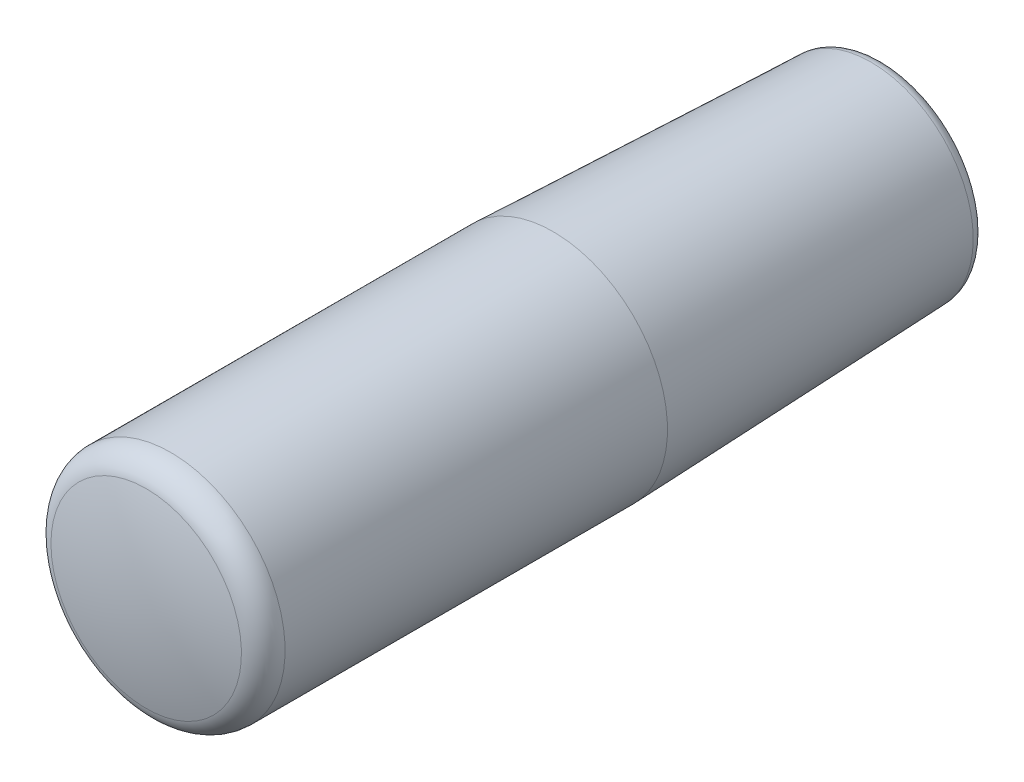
ISO-10303-21;
HEADER;
FILE_DESCRIPTION(('STEP AP214'),'2;1');
FILE_NAME('part.step','',(''),(''),'','','');
FILE_SCHEMA(('AUTOMOTIVE_DESIGN { 1 0 10303 214 1 1 1 1 }'));
ENDSEC;
DATA;
#1=APPLICATION_CONTEXT('core data for automotive mechanical design processes');
#2=APPLICATION_PROTOCOL_DEFINITION('international standard','automotive_design',2000,#1);
#3=PRODUCT_CONTEXT('',#1,'mechanical');
#4=PRODUCT('Part','Part','',(#3));
#5=PRODUCT_RELATED_PRODUCT_CATEGORY('part','',(#4));
#6=PRODUCT_DEFINITION_FORMATION('','',#4);
#7=PRODUCT_DEFINITION_CONTEXT('part definition',#1,'design');
#8=PRODUCT_DEFINITION('design','',#6,#7);
#9=PRODUCT_DEFINITION_SHAPE('','',#8);
#10=(LENGTH_UNIT() NAMED_UNIT(*) SI_UNIT(.MILLI.,.METRE.));
#11=(NAMED_UNIT(*) PLANE_ANGLE_UNIT() SI_UNIT($,.RADIAN.));
#12=(NAMED_UNIT(*) SI_UNIT($,.STERADIAN.) SOLID_ANGLE_UNIT());
#13=UNCERTAINTY_MEASURE_WITH_UNIT(LENGTH_MEASURE(1.E-05),#10,'distance_accuracy_value','');
#14=(GEOMETRIC_REPRESENTATION_CONTEXT(3) GLOBAL_UNCERTAINTY_ASSIGNED_CONTEXT((#13)) GLOBAL_UNIT_ASSIGNED_CONTEXT((#10,
#11,#12)) REPRESENTATION_CONTEXT('',''));
#15=CARTESIAN_POINT('',(0.,0.,0.));
#16=DIRECTION('',(0.,0.,1.));
#17=DIRECTION('',(1.,0.,0.));
#18=AXIS2_PLACEMENT_3D('',#15,#16,#17);
#19=CARTESIAN_POINT('',(0.,7.03772216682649,0.));
#20=DIRECTION('',(0.,0.,-1.));
#21=DIRECTION('',(-1.,0.,0.));
#22=AXIS2_PLACEMENT_3D('',#19,#20,#21);
#23=PLANE('',#22);
#24=CARTESIAN_POINT('',(0.,0.,0.));
#25=DIRECTION('',(0.,0.,-1.));
#26=DIRECTION('',(-1.,0.,0.));
#27=AXIS2_PLACEMENT_3D('',#24,#25,#26);
#28=CIRCLE('',#27,3.45);
#29=CARTESIAN_POINT('',(-3.45,0.,0.));
#30=VERTEX_POINT('',#29);
#31=EDGE_CURVE('E8',#30,#30,#28,.F.);
#32=ORIENTED_EDGE('',*,*,#31,.T.);
#33=EDGE_LOOP('',(#32));
#34=FACE_BOUND('',#33,.T.);
#35=CARTESIAN_POINT('',(0.,0.,0.));
#36=DIRECTION('',(0.,0.,-1.));
#37=DIRECTION('',(-1.,0.,0.));
#38=AXIS2_PLACEMENT_3D('',#35,#36,#37);
#39=CIRCLE('',#38,7.03772216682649);
#40=CARTESIAN_POINT('',(-7.03772216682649,0.,0.));
#41=VERTEX_POINT('',#40);
#42=EDGE_CURVE('E23',#41,#41,#39,.T.);
#43=ORIENTED_EDGE('',*,*,#42,.T.);
#44=EDGE_LOOP('',(#43));
#45=FACE_BOUND('',#44,.T.);
#46=ADVANCED_FACE('F12',(#34,#45),#23,.T.);
#47=CARTESIAN_POINT('',(0.,0.,1.));
#48=DIRECTION('',(0.,0.,-1.));
#49=DIRECTION('',(-1.,0.,0.));
#50=AXIS2_PLACEMENT_3D('',#47,#48,#49);
#51=TOROIDAL_SURFACE('',#50,7.03772216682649,1.);
#52=CARTESIAN_POINT('',(0.,0.,0.961566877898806));
#53=DIRECTION('',(0.,0.,-1.));
#54=DIRECTION('',(-1.,0.,0.));
#55=AXIS2_PLACEMENT_3D('',#52,#53,#54);
#56=CIRCLE('',#55,8.0369833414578);
#57=CARTESIAN_POINT('',(-8.0369833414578,0.,0.961566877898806));
#58=VERTEX_POINT('',#57);
#59=EDGE_CURVE('E27',#58,#58,#56,.T.);
#60=ORIENTED_EDGE('',*,*,#59,.T.);
#61=EDGE_LOOP('',(#60));
#62=FACE_BOUND('',#61,.T.);
#63=ORIENTED_EDGE('',*,*,#42,.F.);
#64=EDGE_LOOP('',(#63));
#65=FACE_BOUND('',#64,.T.);
#66=ADVANCED_FACE('F62',(#62,#65),#51,.T.);
#67=CARTESIAN_POINT('',(0.,0.,0.961566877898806));
#68=DIRECTION('',(0.,0.,1.));
#69=DIRECTION('',(1.,0.,0.));
#70=AXIS2_PLACEMENT_3D('',#67,#68,#69);
#71=CONICAL_SURFACE('',#70,8.0369833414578,0.0384425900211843);
#72=CARTESIAN_POINT('',(0.,0.,26.));
#73=DIRECTION('',(0.,0.,-1.));
#74=DIRECTION('',(-1.,0.,0.));
#75=AXIS2_PLACEMENT_3D('',#72,#73,#74);
#76=CIRCLE('',#75,9.);
#77=CARTESIAN_POINT('',(-9.,0.,26.));
#78=VERTEX_POINT('',#77);
#79=EDGE_CURVE('E32',#78,#78,#76,.T.);
#80=ORIENTED_EDGE('',*,*,#79,.T.);
#81=EDGE_LOOP('',(#80));
#82=FACE_BOUND('',#81,.T.);
#83=ORIENTED_EDGE('',*,*,#59,.F.);
#84=EDGE_LOOP('',(#83));
#85=FACE_BOUND('',#84,.T.);
#86=ADVANCED_FACE('F67',(#82,#85),#71,.T.);
#87=CARTESIAN_POINT('',(0.,0.,-5.));
#88=DIRECTION('',(0.,0.,-1.));
#89=DIRECTION('',(-1.,0.,0.));
#90=AXIS2_PLACEMENT_3D('',#87,#88,#89);
#91=CYLINDRICAL_SURFACE('',#90,9.);
#92=CARTESIAN_POINT('',(0.,0.,56.1108834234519));
#93=DIRECTION('',(0.,0.,-1.));
#94=DIRECTION('',(-1.,0.,0.));
#95=AXIS2_PLACEMENT_3D('',#92,#93,#94);
#96=CIRCLE('',#95,9.);
#97=CARTESIAN_POINT('',(-9.,0.,56.1108834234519));
#98=VERTEX_POINT('',#97);
#99=EDGE_CURVE('E35',#98,#98,#96,.T.);
#100=ORIENTED_EDGE('',*,*,#99,.T.);
#101=EDGE_LOOP('',(#100));
#102=FACE_BOUND('',#101,.T.);
#103=ORIENTED_EDGE('',*,*,#79,.F.);
#104=EDGE_LOOP('',(#103));
#105=FACE_BOUND('',#104,.T.);
#106=ADVANCED_FACE('F74',(#102,#105),#91,.T.);
#107=CARTESIAN_POINT('',(0.,0.,56.1108834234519));
#108=DIRECTION('',(0.,0.,-1.));
#109=DIRECTION('',(-1.,0.,0.));
#110=AXIS2_PLACEMENT_3D('',#107,#108,#109);
#111=TOROIDAL_SURFACE('',#110,7.,2.);
#112=CARTESIAN_POINT('',(0.,0.,58.0473750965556));
#113=DIRECTION('',(0.,0.,-1.));
#114=DIRECTION('',(-1.,0.,0.));
#115=AXIS2_PLACEMENT_3D('',#112,#113,#114);
#116=CIRCLE('',#115,7.50000000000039);
#117=CARTESIAN_POINT('',(-7.50000000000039,0.,58.0473750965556));
#118=VERTEX_POINT('',#117);
#119=EDGE_CURVE('E38',#118,#118,#116,.T.);
#120=ORIENTED_EDGE('',*,*,#119,.T.);
#121=EDGE_LOOP('',(#120));
#122=FACE_BOUND('',#121,.T.);
#123=ORIENTED_EDGE('',*,*,#99,.F.);
#124=EDGE_LOOP('',(#123));
#125=FACE_BOUND('',#124,.T.);
#126=ADVANCED_FACE('F58',(#122,#125),#111,.T.);
#127=CARTESIAN_POINT('',(0.,0.,29.));
#128=DIRECTION('',(0.,0.,-1.));
#129=DIRECTION('',(0.,1.,0.));
#130=AXIS2_PLACEMENT_3D('',#127,#128,#129);
#131=SPHERICAL_SURFACE('',#130,30.);
#132=ORIENTED_EDGE('',*,*,#119,.F.);
#133=EDGE_LOOP('',(#132));
#134=FACE_BOUND('',#133,.T.);
#135=ADVANCED_FACE('F49',(#134),#131,.T.);
#136=CARTESIAN_POINT('',(0.,0.,10.));
#137=DIRECTION('',(0.,0.,-1.));
#138=DIRECTION('',(-1.,0.,0.));
#139=AXIS2_PLACEMENT_3D('',#136,#137,#138);
#140=CYLINDRICAL_SURFACE('',#139,3.);
#141=CARTESIAN_POINT('',(0.,0.,0.449999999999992));
#142=DIRECTION('',(0.,0.,-1.));
#143=DIRECTION('',(-1.,0.,0.));
#144=AXIS2_PLACEMENT_3D('',#141,#142,#143);
#145=CIRCLE('',#144,3.);
#146=CARTESIAN_POINT('',(-3.,0.,0.449999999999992));
#147=VERTEX_POINT('',#146);
#148=EDGE_CURVE('E19',#147,#147,#145,.T.);
#149=ORIENTED_EDGE('',*,*,#148,.T.);
#150=EDGE_LOOP('',(#149));
#151=FACE_BOUND('',#150,.T.);
#152=CARTESIAN_POINT('',(0.,0.,10.));
#153=DIRECTION('',(0.,0.,-1.));
#154=DIRECTION('',(-1.,0.,0.));
#155=AXIS2_PLACEMENT_3D('',#152,#153,#154);
#156=CIRCLE('',#155,3.);
#157=CARTESIAN_POINT('',(-3.,0.,10.));
#158=VERTEX_POINT('',#157);
#159=EDGE_CURVE('E41',#158,#158,#156,.T.);
#160=ORIENTED_EDGE('',*,*,#159,.F.);
#161=EDGE_LOOP('',(#160));
#162=FACE_BOUND('',#161,.T.);
#163=ADVANCED_FACE('F47',(#151,#162),#140,.F.);
#164=CARTESIAN_POINT('',(0.,0.,10.));
#165=DIRECTION('',(0.,0.,-1.));
#166=DIRECTION('',(-1.,0.,0.));
#167=AXIS2_PLACEMENT_3D('',#164,#165,#166);
#168=PLANE('',#167);
#169=ORIENTED_EDGE('',*,*,#159,.T.);
#170=EDGE_LOOP('',(#169));
#171=FACE_BOUND('',#170,.T.);
#172=ADVANCED_FACE('F45',(#171),#168,.T.);
#173=CARTESIAN_POINT('',(0.,0.,0.449999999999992));
#174=DIRECTION('',(0.,0.,-1.));
#175=DIRECTION('',(-1.,0.,0.));
#176=AXIS2_PLACEMENT_3D('',#173,#174,#175);
#177=CONICAL_SURFACE('',#176,3.,0.785398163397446);
#178=ORIENTED_EDGE('',*,*,#31,.F.);
#179=EDGE_LOOP('',(#178));
#180=FACE_BOUND('',#179,.T.);
#181=ORIENTED_EDGE('',*,*,#148,.F.);
#182=EDGE_LOOP('',(#181));
#183=FACE_BOUND('',#182,.T.);
#184=ADVANCED_FACE('F14',(#180,#183),#177,.F.);
#185=CLOSED_SHELL('',(#46,#66,#86,#106,#126,#135,#163,#172,#184));
#186=MANIFOLD_SOLID_BREP('B1',#185);
#187=ADVANCED_BREP_SHAPE_REPRESENTATION('',(#18,#186),#14);
#188=SHAPE_DEFINITION_REPRESENTATION(#9,#187);
ENDSEC;
END-ISO-10303-21;
